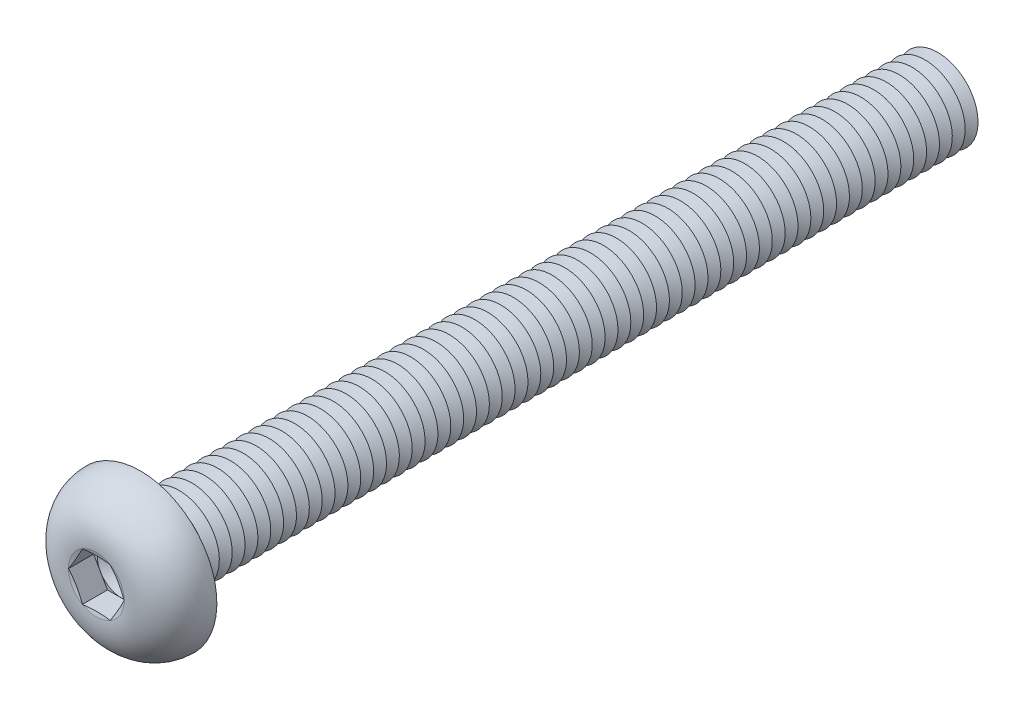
from build123d import *

# Parameters (mm, degrees)
FILLET1_R          = 0.4
LPATTERN1_COUNT    = 62
LPATTERN1_PITCH    = 0.8
CUT_EXTRUDE1_DEPTH = 1.56


with BuildPart() as part:
    # Sketch1 → Revolve1 (revolve)
    with BuildSketch(Plane(origin=(0, 0, 0), x_dir=(0, 0, -1), z_dir=(1, 0, 0))):
        with BuildLine():
            Line((0, 2.5), (0, 4.75))
            ThreePointArc((0, 4.75), (-2.041477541, 3.848329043), (-2.75, 1.73205))
            Line((-2.75, 1.73205), (-2.517949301, 0.866025))
            Line((-2.517949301, 0.866025), (-2.75, 0.866025))
            Line((-2.75, 0.866025), (-2.75, 0))
            Line((-2.75, 0), (50, 0))
            Line((50, 0), (50, 2.5))
            Line((50, 2.5), (0, 2.5))
        make_face()
    revolve(axis=Axis((0, 0, -50), (0, 0, 1)))

    # Fillet1
    fillet1_edges = [part.edges().sort_by_distance(p)[0] for p in [
        (0, -2.5, 0),
    ]]
    fillet(fillet1_edges, radius=FILLET1_R)

    # Sketch2 → Cut-Revolve1 (revolve, cut)
    with BuildSketch(Plane(origin=(0, 0, 0), x_dir=(0, 0, -1), z_dir=(1, 0, 0))):
        Polygon((49.6, 2.5), (50.4, 2.5), (50, 1.807179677), align=None)
    cut_revolve1 = revolve(axis=Axis((0, 0, -50), (0, 0, -1)), mode=Mode.SUBTRACT)

    # LPattern1: Cut-Revolve1 ×62
    with Locations(*[(0, 0, i * LPATTERN1_PITCH) for i in range(1, LPATTERN1_COUNT)]):
        add(cut_revolve1, mode=Mode.SUBTRACT)

    # Sketch3 → Cut-Extrude1 (cut)
    with BuildSketch(Plane.XY.offset(2.75)):
        Polygon((0.866025, 1.499999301), (-0.866025, 1.499999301), (-1.73205, 0), (-0.866025, -1.499999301), (0.866025, -1.499999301), (1.73205, 0), align=None)
    extrude(amount=-CUT_EXTRUDE1_DEPTH, mode=Mode.SUBTRACT)

    # Cut-Extrude2 cone 1 section (on through the dimple's axis) → Cut-Extrude2 (revolve, cut)
    with BuildSketch(Plane(origin=(0, 0, 1.19), x_dir=(0, -1, 0), z_dir=(1, 0, 0))):
        Polygon((0, 0), (1.499999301, 0), (0, 0.866025), align=None)
    revolve(axis=Axis((0, 0, 1.19), (0, 0, -1)), mode=Mode.SUBTRACT)


solid = part.part
